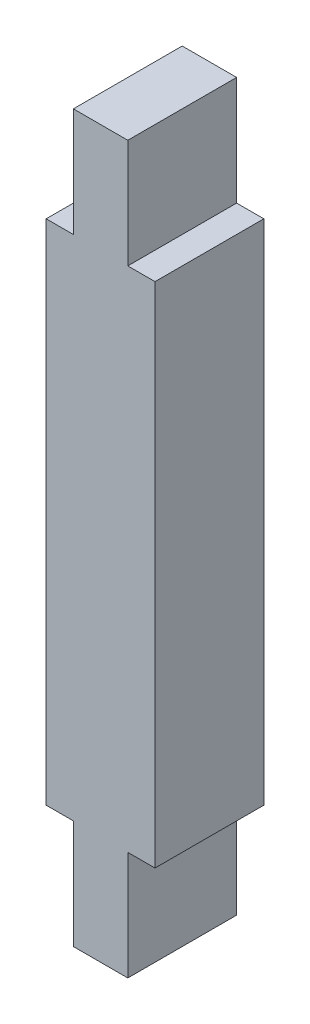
from build123d import *

# Parameters (mm, degrees)
SKETCH1_W           = 4.7625
SKETCH1_H           = 19.05
BOSS_EXTRUDE1_DEPTH = 19.05


with BuildPart() as part:
    # Sketch1 → Boss-Extrude1 (new body)
    with BuildSketch(Plane.XY):
        Polygon((14.2875, 88.9), (9.525, 88.9), (4.7625, 88.9), (0, 88.9), (0, 44.45), (19.05, 44.45), (19.05, 88.9), align=None)
        Polygon((19.05, 44.45), (0, 44.45), (0, 0), (4.7625, 0), (9.525, 0), (14.2875, 0), (19.05, 0), align=None)
        with Locations((7.14375, -9.525)):
            Rectangle(SKETCH1_W, SKETCH1_H)
        with Locations((11.90625, -9.525)):
            Rectangle(SKETCH1_W, SKETCH1_H)
        with Locations((7.14375, 98.425)):
            Rectangle(SKETCH1_W, SKETCH1_H)
        with Locations((11.90625, 98.425)):
            Rectangle(SKETCH1_W, SKETCH1_H)
    extrude(amount=BOSS_EXTRUDE1_DEPTH)


solid = part.part
